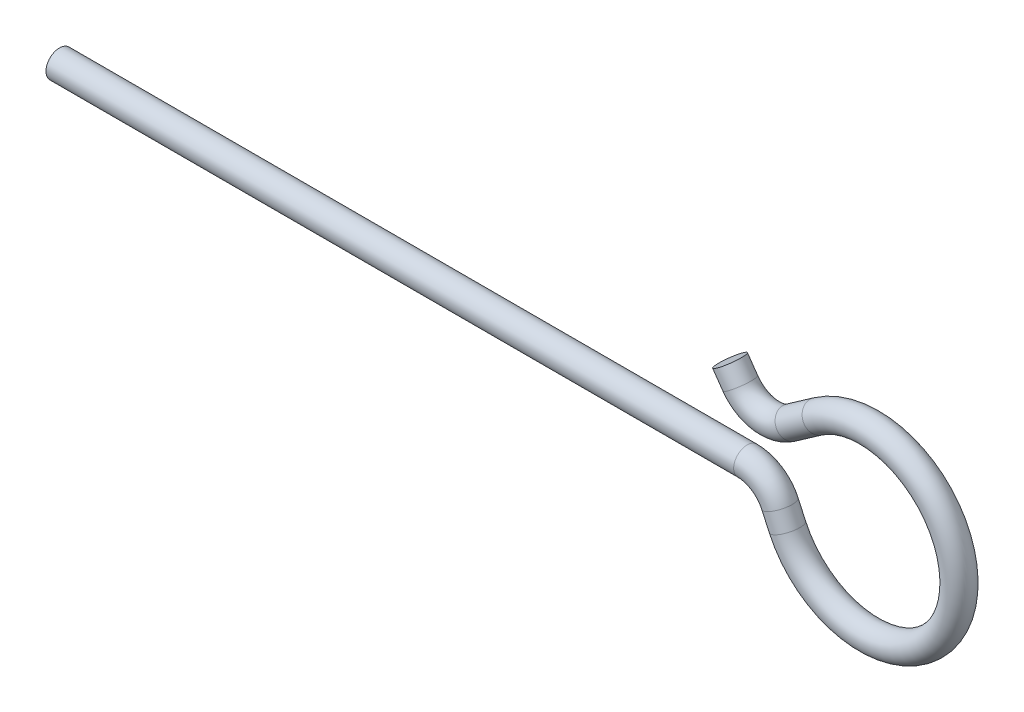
ISO-10303-21;
HEADER;
FILE_DESCRIPTION(('STEP AP214'),'2;1');
FILE_NAME('part.step','',(''),(''),'','','');
FILE_SCHEMA(('AUTOMOTIVE_DESIGN { 1 0 10303 214 1 1 1 1 }'));
ENDSEC;
DATA;
#1=APPLICATION_CONTEXT('core data for automotive mechanical design processes');
#2=APPLICATION_PROTOCOL_DEFINITION('international standard','automotive_design',2000,#1);
#3=PRODUCT_CONTEXT('',#1,'mechanical');
#4=PRODUCT('Part','Part','',(#3));
#5=PRODUCT_RELATED_PRODUCT_CATEGORY('part','',(#4));
#6=PRODUCT_DEFINITION_FORMATION('','',#4);
#7=PRODUCT_DEFINITION_CONTEXT('part definition',#1,'design');
#8=PRODUCT_DEFINITION('design','',#6,#7);
#9=PRODUCT_DEFINITION_SHAPE('','',#8);
#10=(LENGTH_UNIT() NAMED_UNIT(*) SI_UNIT(.MILLI.,.METRE.));
#11=(NAMED_UNIT(*) PLANE_ANGLE_UNIT() SI_UNIT($,.RADIAN.));
#12=(NAMED_UNIT(*) SI_UNIT($,.STERADIAN.) SOLID_ANGLE_UNIT());
#13=UNCERTAINTY_MEASURE_WITH_UNIT(LENGTH_MEASURE(1.E-05),#10,'distance_accuracy_value','');
#14=(GEOMETRIC_REPRESENTATION_CONTEXT(3) GLOBAL_UNCERTAINTY_ASSIGNED_CONTEXT((#13)) GLOBAL_UNIT_ASSIGNED_CONTEXT((#10,
#11,#12)) REPRESENTATION_CONTEXT('',''));
#15=CARTESIAN_POINT('',(0.,0.,0.));
#16=DIRECTION('',(0.,0.,1.));
#17=DIRECTION('',(1.,0.,0.));
#18=AXIS2_PLACEMENT_3D('',#15,#16,#17);
#19=CARTESIAN_POINT('',(37.8396732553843,3.53148421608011,-0.005144));
#20=DIRECTION('',(-0.573615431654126,0.819124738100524,0.));
#21=DIRECTION('',(-0.819124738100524,-0.573615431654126,0.));
#22=AXIS2_PLACEMENT_3D('',#19,#20,#21);
#23=CYLINDRICAL_SURFACE('',#22,0.75);
#24=CARTESIAN_POINT('',(37.8396732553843,3.53148421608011,-0.005144));
#25=DIRECTION('',(-0.573615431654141,0.819124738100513,0.));
#26=DIRECTION('',(0.,0.,-1.));
#27=AXIS2_PLACEMENT_3D('',#24,#25,#26);
#28=CIRCLE('',#27,0.75);
#29=CARTESIAN_POINT('',(37.2253297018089,3.10127264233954,-0.005144));
#30=VERTEX_POINT('',#29);
#31=EDGE_CURVE('E30',#30,#30,#28,.T.);
#32=ORIENTED_EDGE('',*,*,#31,.T.);
#33=EDGE_LOOP('',(#32));
#34=FACE_BOUND('',#33,.T.);
#35=CARTESIAN_POINT('',(37.2660578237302,4.35060895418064,-0.005144));
#36=DIRECTION('',(-0.573615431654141,0.819124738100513,0.));
#37=DIRECTION('',(0.,0.,-1.));
#38=AXIS2_PLACEMENT_3D('',#35,#36,#37);
#39=CIRCLE('',#38,0.75);
#40=CARTESIAN_POINT('',(37.2660578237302,4.35060895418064,-0.755144));
#41=VERTEX_POINT('',#40);
#42=EDGE_CURVE('E10',#41,#41,#39,.T.);
#43=ORIENTED_EDGE('',*,*,#42,.F.);
#44=EDGE_LOOP('',(#43));
#45=FACE_BOUND('',#44,.T.);
#46=ADVANCED_FACE('F24',(#34,#45),#23,.T.);
#47=CARTESIAN_POINT('',(39.4846919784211,4.6834554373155,-0.005144));
#48=DIRECTION('',(0.,0.,-1.));
#49=DIRECTION('',(-1.,0.,0.));
#50=AXIS2_PLACEMENT_3D('',#47,#48,#49);
#51=TOROIDAL_SURFACE('',#50,2.008264,0.75);
#52=CARTESIAN_POINT('',(40.6366631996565,3.03843671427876,-0.005144));
#53=DIRECTION('',(-0.819124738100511,-0.573615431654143,0.));
#54=DIRECTION('',(0.,0.,-1.));
#55=AXIS2_PLACEMENT_3D('',#52,#53,#54);
#56=CIRCLE('',#55,0.75);
#57=CARTESIAN_POINT('',(41.066874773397,2.42409316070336,-0.005144));
#58=VERTEX_POINT('',#57);
#59=EDGE_CURVE('E34',#58,#58,#56,.T.);
#60=CARTESIAN_POINT('',(39.4846919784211,4.6834554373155,-0.005144));
#61=DIRECTION('',(0.,0.,-1.));
#62=DIRECTION('',(-1.,0.,0.));
#63=AXIS2_PLACEMENT_3D('',#60,#61,#62);
#64=CIRCLE('',#63,2.758264);
#65=EDGE_CURVE('',#58,#30,#64,.T.);
#66=ORIENTED_EDGE('',*,*,#59,.T.);
#67=ORIENTED_EDGE('',*,*,#31,.F.);
#68=ORIENTED_EDGE('',*,*,#65,.T.);
#69=ORIENTED_EDGE('',*,*,#65,.F.);
#70=EDGE_LOOP('',(#66,#68,#67,#69));
#71=FACE_BOUND('',#70,.T.);
#72=ADVANCED_FACE('F67',(#71),#51,.T.);
#73=CARTESIAN_POINT('',(42.1366631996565,4.0888544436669,-0.005144));
#74=DIRECTION('',(-0.819124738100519,-0.573615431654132,0.));
#75=DIRECTION('',(0.573615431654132,-0.819124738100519,0.));
#76=AXIS2_PLACEMENT_3D('',#73,#74,#75);
#77=CYLINDRICAL_SURFACE('',#76,0.75);
#78=CARTESIAN_POINT('',(42.1366631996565,4.0888544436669,-0.005144));
#79=DIRECTION('',(-0.819124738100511,-0.573615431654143,0.));
#80=DIRECTION('',(0.,0.,-1.));
#81=AXIS2_PLACEMENT_3D('',#78,#79,#80);
#82=CIRCLE('',#81,0.75);
#83=CARTESIAN_POINT('',(41.7064516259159,4.70319799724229,-0.005144));
#84=VERTEX_POINT('',#83);
#85=EDGE_CURVE('E38',#84,#84,#82,.T.);
#86=ORIENTED_EDGE('',*,*,#85,.T.);
#87=EDGE_LOOP('',(#86));
#88=FACE_BOUND('',#87,.T.);
#89=ORIENTED_EDGE('',*,*,#59,.F.);
#90=EDGE_LOOP('',(#89));
#91=FACE_BOUND('',#90,.T.);
#92=ADVANCED_FACE('F71',(#88,#91),#77,.T.);
#93=CARTESIAN_POINT('',(45.,0.,-0.005144));
#94=DIRECTION('',(0.,0.,1.));
#95=DIRECTION('',(1.,0.,0.));
#96=AXIS2_PLACEMENT_3D('',#93,#94,#95);
#97=TOROIDAL_SURFACE('',#96,4.99173600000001,0.75);
#98=CARTESIAN_POINT('',(40.4598853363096,-2.07479809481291,-0.005144));
#99=DIRECTION('',(0.415646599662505,-0.909526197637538,0.));
#100=DIRECTION('',(0.,0.,-1.));
#101=AXIS2_PLACEMENT_3D('',#98,#99,#100);
#102=CIRCLE('',#101,0.75);
#103=CARTESIAN_POINT('',(39.7777406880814,-2.38653304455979,-0.005144));
#104=VERTEX_POINT('',#103);
#105=EDGE_CURVE('E43',#104,#104,#102,.T.);
#106=CARTESIAN_POINT('',(45.,0.,-0.005144));
#107=DIRECTION('',(0.,0.,1.));
#108=DIRECTION('',(1.,0.,0.));
#109=AXIS2_PLACEMENT_3D('',#106,#107,#108);
#110=CIRCLE('',#109,5.74173600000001);
#111=EDGE_CURVE('',#104,#84,#110,.T.);
#112=ORIENTED_EDGE('',*,*,#105,.T.);
#113=ORIENTED_EDGE('',*,*,#85,.F.);
#114=ORIENTED_EDGE('',*,*,#111,.T.);
#115=ORIENTED_EDGE('',*,*,#111,.F.);
#116=EDGE_LOOP('',(#112,#114,#113,#115));
#117=FACE_BOUND('',#116,.T.);
#118=ADVANCED_FACE('F77',(#117),#97,.T.);
#119=CARTESIAN_POINT('',(40.0442387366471,-1.16527189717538,-0.005144));
#120=DIRECTION('',(0.415646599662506,-0.909526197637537,0.));
#121=DIRECTION('',(0.909526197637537,0.415646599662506,0.));
#122=AXIS2_PLACEMENT_3D('',#119,#120,#121);
#123=CYLINDRICAL_SURFACE('',#122,0.75);
#124=CARTESIAN_POINT('',(40.0442387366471,-1.16527189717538,-0.005144));
#125=DIRECTION('',(0.415646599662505,-0.909526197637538,0.));
#126=DIRECTION('',(0.,0.,-1.));
#127=AXIS2_PLACEMENT_3D('',#124,#125,#126);
#128=CIRCLE('',#127,0.75);
#129=CARTESIAN_POINT('',(40.7263833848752,-0.853536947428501,-0.005144));
#130=VERTEX_POINT('',#129);
#131=EDGE_CURVE('E46',#130,#130,#128,.T.);
#132=ORIENTED_EDGE('',*,*,#131,.T.);
#133=EDGE_LOOP('',(#132));
#134=FACE_BOUND('',#133,.T.);
#135=ORIENTED_EDGE('',*,*,#105,.F.);
#136=EDGE_LOOP('',(#135));
#137=FACE_BOUND('',#136,.T.);
#138=ADVANCED_FACE('F84',(#134,#137),#123,.T.);
#139=CARTESIAN_POINT('',(38.2176700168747,-2.,-0.005144));
#140=DIRECTION('',(0.,0.,-1.));
#141=DIRECTION('',(-1.,0.,0.));
#142=AXIS2_PLACEMENT_3D('',#139,#140,#141);
#143=TOROIDAL_SURFACE('',#142,2.008264,0.75);
#144=CARTESIAN_POINT('',(38.2176700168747,0.008264,-0.005144));
#145=DIRECTION('',(1.,0.,0.));
#146=DIRECTION('',(0.,0.,-1.));
#147=AXIS2_PLACEMENT_3D('',#144,#145,#146);
#148=CIRCLE('',#147,0.75);
#149=CARTESIAN_POINT('',(38.2176700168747,0.758264,-0.005144));
#150=VERTEX_POINT('',#149);
#151=EDGE_CURVE('E49',#150,#150,#148,.T.);
#152=CARTESIAN_POINT('',(38.2176700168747,-2.,-0.005144));
#153=DIRECTION('',(0.,0.,-1.));
#154=DIRECTION('',(-1.,0.,0.));
#155=AXIS2_PLACEMENT_3D('',#152,#153,#154);
#156=CIRCLE('',#155,2.758264);
#157=EDGE_CURVE('',#150,#130,#156,.T.);
#158=ORIENTED_EDGE('',*,*,#151,.T.);
#159=ORIENTED_EDGE('',*,*,#131,.F.);
#160=ORIENTED_EDGE('',*,*,#157,.T.);
#161=ORIENTED_EDGE('',*,*,#157,.F.);
#162=EDGE_LOOP('',(#158,#160,#159,#161));
#163=FACE_BOUND('',#162,.T.);
#164=ADVANCED_FACE('F88',(#163),#143,.T.);
#165=CARTESIAN_POINT('',(38.2176700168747,0.008264,-0.005144));
#166=DIRECTION('',(-1.,0.,0.));
#167=DIRECTION('',(0.,0.,1.));
#168=AXIS2_PLACEMENT_3D('',#165,#166,#167);
#169=CYLINDRICAL_SURFACE('',#168,0.75);
#170=ORIENTED_EDGE('',*,*,#151,.F.);
#171=EDGE_LOOP('',(#170));
#172=FACE_BOUND('',#171,.T.);
#173=CARTESIAN_POINT('',(0.,0.008264,-0.005144));
#174=DIRECTION('',(1.,0.,0.));
#175=DIRECTION('',(0.,0.,-1.));
#176=AXIS2_PLACEMENT_3D('',#173,#174,#175);
#177=CIRCLE('',#176,0.75);
#178=CARTESIAN_POINT('',(0.,0.008264,-0.755144));
#179=VERTEX_POINT('',#178);
#180=EDGE_CURVE('E52',#179,#179,#177,.T.);
#181=ORIENTED_EDGE('',*,*,#180,.T.);
#182=EDGE_LOOP('',(#181));
#183=FACE_BOUND('',#182,.T.);
#184=ADVANCED_FACE('F56',(#172,#183),#169,.T.);
#185=CARTESIAN_POINT('',(37.2660578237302,4.35060895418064,-0.005144));
#186=DIRECTION('',(-0.573615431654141,0.819124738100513,0.));
#187=DIRECTION('',(0.,0.,-1.));
#188=AXIS2_PLACEMENT_3D('',#185,#186,#187);
#189=PLANE('',#188);
#190=ORIENTED_EDGE('',*,*,#42,.T.);
#191=EDGE_LOOP('',(#190));
#192=FACE_BOUND('',#191,.T.);
#193=ADVANCED_FACE('F60',(#192),#189,.T.);
#194=CARTESIAN_POINT('',(0.,0.008264,-0.005144));
#195=DIRECTION('',(1.,0.,0.));
#196=DIRECTION('',(0.,0.,-1.));
#197=AXIS2_PLACEMENT_3D('',#194,#195,#196);
#198=PLANE('',#197);
#199=ORIENTED_EDGE('',*,*,#180,.F.);
#200=EDGE_LOOP('',(#199));
#201=FACE_BOUND('',#200,.T.);
#202=ADVANCED_FACE('F58',(#201),#198,.F.);
#203=CLOSED_SHELL('',(#46,#72,#92,#118,#138,#164,#184,#193,#202));
#204=MANIFOLD_SOLID_BREP('B2',#203);
#205=ADVANCED_BREP_SHAPE_REPRESENTATION('',(#18,#204),#14);
#206=SHAPE_DEFINITION_REPRESENTATION(#9,#205);
ENDSEC;
END-ISO-10303-21;
